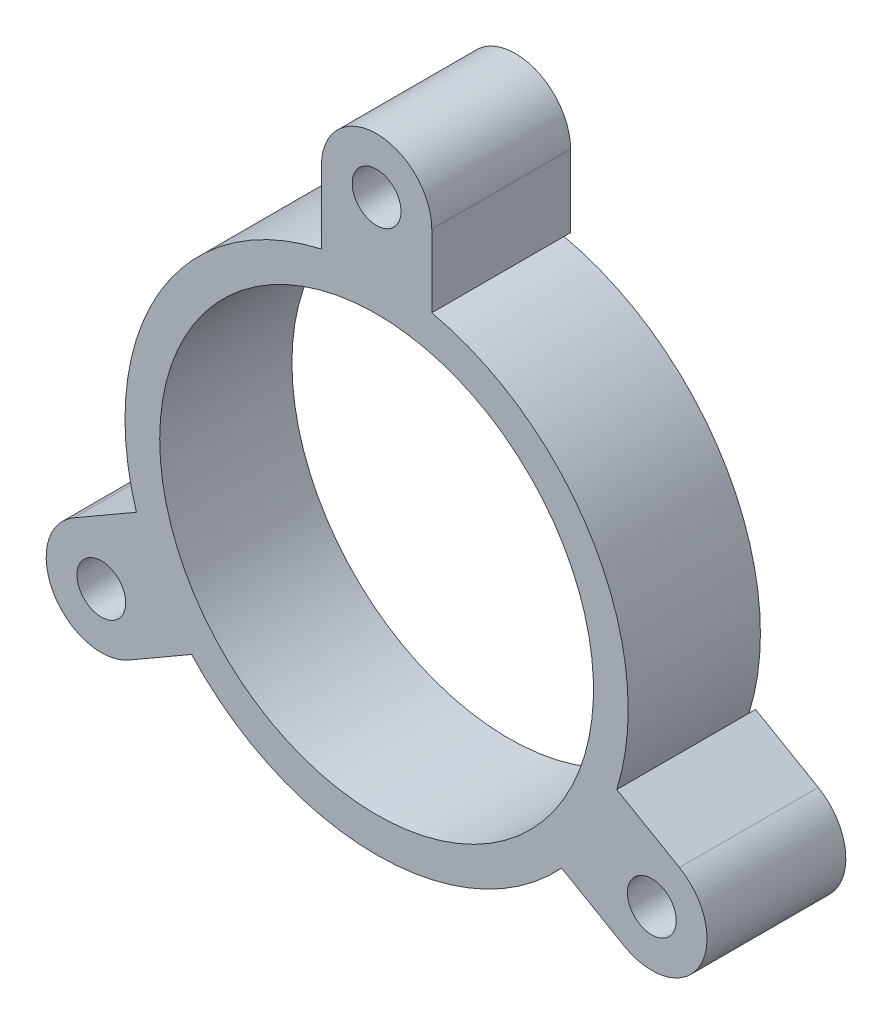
from build123d import *

# Parameters (mm, degrees)
SKETCH1_R           = 14.5
SKETCH1_R_2         = 12.5
BASE_EXTRUDE_DEPTH  = 7.62
BOSS_EXTRUDE1_START = -8
SKETCH5_R           = 1.405
BOSS_EXTRUDE1_DEPTH = 8


with BuildPart() as part:
    # Sketch1 → Base-Extrude (new body)
    with BuildSketch(Plane.XY):
        Circle(SKETCH1_R)
        with Locations(Location((0, 0, 0), (0, 0, 180))):
            Circle(SKETCH1_R_2, mode=Mode.SUBTRACT)
    extrude(amount=BASE_EXTRUDE_DEPTH)

    # Sketch5 → Boss-Extrude1 (add)
    # profile 1 of 3: a face of its own
    with BuildSketch(Plane.XY.offset(7.62).offset(BOSS_EXTRUDE1_START)):
        with BuildLine():
            Line((3.18, 14.146999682), (3.18, 18.316999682))
            ThreePointArc((3.18, 18.316999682), (0, 21.496999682), (-3.18, 18.316999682))
            Line((-3.18, 18.316999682), (-3.18, 14.146999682))
            ThreePointArc((-3.18, 14.146999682), (0, 14.5), (3.18, 14.146999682))
        make_face()
        with Locations((0, 18.316999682)):
            Circle(SKETCH5_R, mode=Mode.SUBTRACT)
    # profile 2 of 3: a face of its own
    with BuildSketch(Plane.XY.offset(7.62).offset(BOSS_EXTRUDE1_START)):
        with BuildLine():
            Line((13.841661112, -4.319539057), (17.452987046, -6.404539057))
            ThreePointArc((17.452987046, -6.404539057), (18.61694783, -10.748499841), (14.272987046, -11.912460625))
            Line((14.272987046, -11.912460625), (10.661661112, -9.827460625))
            ThreePointArc((10.661661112, -9.827460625), (12.557368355, -7.25), (13.841661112, -4.319539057))
        make_face()
        with Locations(Location((15.862987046, -9.158499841, 0), (0, 0, 180))):
            Circle(SKETCH5_R, mode=Mode.SUBTRACT)
    # profile 3 of 3: a face of its own
    with BuildSketch(Plane.XY.offset(7.62).offset(BOSS_EXTRUDE1_START)):
        with BuildLine():
            Line((-10.661661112, -9.827460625), (-14.272987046, -11.912460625))
            ThreePointArc((-14.272987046, -11.912460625), (-18.61694783, -10.748499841), (-17.452987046, -6.404539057))
            Line((-17.452987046, -6.404539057), (-13.841661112, -4.319539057))
            ThreePointArc((-13.841661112, -4.319539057), (-12.557368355, -7.25), (-10.661661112, -9.827460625))
        make_face()
        with Locations((-15.862987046, -9.158499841)):
            Circle(SKETCH5_R, mode=Mode.SUBTRACT)
    extrude(amount=BOSS_EXTRUDE1_DEPTH)


solid = part.part
